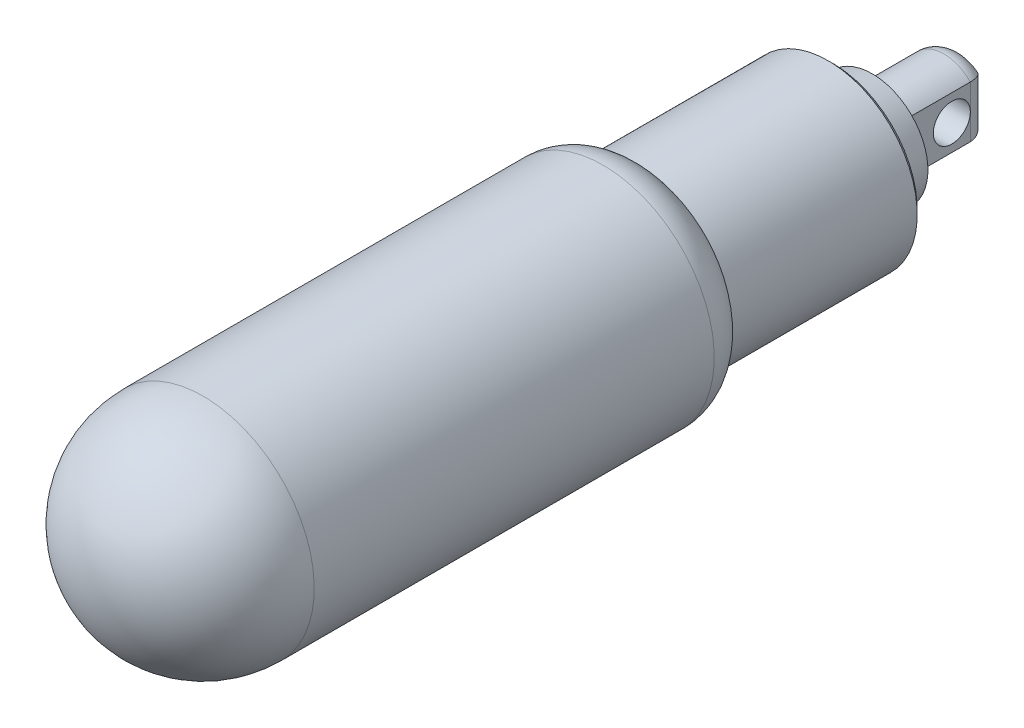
ISO-10303-21;
HEADER;
FILE_DESCRIPTION(('STEP AP214'),'2;1');
FILE_NAME('part.step','',(''),(''),'','','');
FILE_SCHEMA(('AUTOMOTIVE_DESIGN { 1 0 10303 214 1 1 1 1 }'));
ENDSEC;
DATA;
#1=APPLICATION_CONTEXT('core data for automotive mechanical design processes');
#2=APPLICATION_PROTOCOL_DEFINITION('international standard','automotive_design',2000,#1);
#3=PRODUCT_CONTEXT('',#1,'mechanical');
#4=PRODUCT('Part','Part','',(#3));
#5=PRODUCT_RELATED_PRODUCT_CATEGORY('part','',(#4));
#6=PRODUCT_DEFINITION_FORMATION('','',#4);
#7=PRODUCT_DEFINITION_CONTEXT('part definition',#1,'design');
#8=PRODUCT_DEFINITION('design','',#6,#7);
#9=PRODUCT_DEFINITION_SHAPE('','',#8);
#10=(LENGTH_UNIT() NAMED_UNIT(*) SI_UNIT(.MILLI.,.METRE.));
#11=(NAMED_UNIT(*) PLANE_ANGLE_UNIT() SI_UNIT($,.RADIAN.));
#12=(NAMED_UNIT(*) SI_UNIT($,.STERADIAN.) SOLID_ANGLE_UNIT());
#13=UNCERTAINTY_MEASURE_WITH_UNIT(LENGTH_MEASURE(1.E-05),#10,'distance_accuracy_value','');
#14=(GEOMETRIC_REPRESENTATION_CONTEXT(3) GLOBAL_UNCERTAINTY_ASSIGNED_CONTEXT((#13)) GLOBAL_UNIT_ASSIGNED_CONTEXT((#10,
#11,#12)) REPRESENTATION_CONTEXT('',''));
#15=CARTESIAN_POINT('',(0.,0.,0.));
#16=DIRECTION('',(0.,0.,1.));
#17=DIRECTION('',(1.,0.,0.));
#18=AXIS2_PLACEMENT_3D('',#15,#16,#17);
#19=CARTESIAN_POINT('',(0.,0.,-4.));
#20=DIRECTION('',(0.,0.,-1.));
#21=DIRECTION('',(-1.,0.,0.));
#22=AXIS2_PLACEMENT_3D('',#19,#20,#21);
#23=CYLINDRICAL_SURFACE('',#22,4.);
#24=DIRECTION('',(0.,0.,-1.));
#25=VECTOR('',#24,1.);
#26=CARTESIAN_POINT('',(-2.8571428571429,2.79941684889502,-4.));
#27=LINE('',#26,#25);
#28=CARTESIAN_POINT('',(-2.8571428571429,2.79941684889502,5.725));
#29=VERTEX_POINT('',#28);
#30=CARTESIAN_POINT('',(-2.8571428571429,2.79941684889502,-2.));
#31=VERTEX_POINT('',#30);
#32=EDGE_CURVE('E348',#29,#31,#27,.T.);
#33=ORIENTED_EDGE('',*,*,#32,.F.);
#34=CARTESIAN_POINT('',(0.,0.,5.725));
#35=DIRECTION('',(0.,0.,-1.));
#36=DIRECTION('',(-1.,0.,0.));
#37=AXIS2_PLACEMENT_3D('',#34,#35,#36);
#38=CIRCLE('',#37,4.);
#39=CARTESIAN_POINT('',(2.8571428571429,2.79941684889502,5.725));
#40=VERTEX_POINT('',#39);
#41=EDGE_CURVE('E101',#29,#40,#38,.T.);
#42=ORIENTED_EDGE('',*,*,#41,.T.);
#43=DIRECTION('',(0.,0.,-1.));
#44=VECTOR('',#43,1.);
#45=CARTESIAN_POINT('',(2.8571428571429,2.79941684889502,-4.));
#46=LINE('',#45,#44);
#47=CARTESIAN_POINT('',(2.8571428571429,2.79941684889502,-2.));
#48=VERTEX_POINT('',#47);
#49=EDGE_CURVE('E90',#48,#40,#46,.F.);
#50=ORIENTED_EDGE('',*,*,#49,.F.);
#51=CARTESIAN_POINT('',(0.,0.,-2.));
#52=DIRECTION('',(0.,0.,-1.));
#53=DIRECTION('',(-1.,0.,0.));
#54=AXIS2_PLACEMENT_3D('',#51,#52,#53);
#55=CIRCLE('',#54,4.);
#56=EDGE_CURVE('E99',#31,#48,#55,.T.);
#57=ORIENTED_EDGE('',*,*,#56,.F.);
#58=EDGE_LOOP('',(#33,#42,#50,#57));
#59=FACE_BOUND('',#58,.T.);
#60=ADVANCED_FACE('F14',(#59),#23,.T.);
#61=DIRECTION('',(0.,0.,-1.));
#62=VECTOR('',#61,1.);
#63=CARTESIAN_POINT('',(2.8571428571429,-2.79941684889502,-4.));
#64=LINE('',#63,#62);
#65=CARTESIAN_POINT('',(2.8571428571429,-2.79941684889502,5.725));
#66=VERTEX_POINT('',#65);
#67=CARTESIAN_POINT('',(2.8571428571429,-2.79941684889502,-2.));
#68=VERTEX_POINT('',#67);
#69=EDGE_CURVE('E102',#66,#68,#64,.T.);
#70=ORIENTED_EDGE('',*,*,#69,.F.);
#71=CARTESIAN_POINT('',(-2.8571428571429,-2.79941684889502,5.725));
#72=VERTEX_POINT('',#71);
#73=EDGE_CURVE('E116',#66,#72,#38,.T.);
#74=ORIENTED_EDGE('',*,*,#73,.T.);
#75=DIRECTION('',(0.,0.,-1.));
#76=VECTOR('',#75,1.);
#77=CARTESIAN_POINT('',(-2.8571428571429,-2.79941684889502,-4.));
#78=LINE('',#77,#76);
#79=CARTESIAN_POINT('',(-2.8571428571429,-2.79941684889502,-2.));
#80=VERTEX_POINT('',#79);
#81=EDGE_CURVE('E347',#80,#72,#78,.F.);
#82=ORIENTED_EDGE('',*,*,#81,.F.);
#83=EDGE_CURVE('E107',#68,#80,#55,.T.);
#84=ORIENTED_EDGE('',*,*,#83,.F.);
#85=EDGE_LOOP('',(#70,#74,#82,#84));
#86=FACE_BOUND('',#85,.T.);
#87=ADVANCED_FACE('F155',(#86),#23,.T.);
#88=CARTESIAN_POINT('',(0.,0.,-2.));
#89=DIRECTION('',(0.,0.,-1.));
#90=DIRECTION('',(-1.,0.,0.));
#91=AXIS2_PLACEMENT_3D('',#88,#89,#90);
#92=DEGENERATE_TOROIDAL_SURFACE('',#91,2.,2.,.T.);
#93=CARTESIAN_POINT('',(-2.8571428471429,2.79941684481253,-1.9998));
#94=CARTESIAN_POINT('',(-2.85715542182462,2.79942031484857,-2.05279635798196));
#95=CARTESIAN_POINT('',(-2.85504711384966,2.79856122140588,-2.10578949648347));
#96=CARTESIAN_POINT('',(-2.84664432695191,2.79512852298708,-2.21137855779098));
#97=CARTESIAN_POINT('',(-2.84035052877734,2.79255519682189,-2.26397454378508));
#98=CARTESIAN_POINT('',(-2.82365184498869,2.7857126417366,-2.36827407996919));
#99=CARTESIAN_POINT('',(-2.81325659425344,2.78144738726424,-2.4199794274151));
#100=CARTESIAN_POINT('',(-2.78847303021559,2.77124535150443,-2.52224127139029));
#101=CARTESIAN_POINT('',(-2.77408468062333,2.76530855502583,-2.57279775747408));
#102=CARTESIAN_POINT('',(-2.7251291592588,2.74502738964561,-2.72220510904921));
#103=CARTESIAN_POINT('',(-2.68475474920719,2.72820548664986,-2.81889700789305));
#104=CARTESIAN_POINT('',(-2.59013913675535,2.6882777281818,-3.00375750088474));
#105=CARTESIAN_POINT('',(-2.53589468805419,2.66517040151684,-3.09192409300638));
#106=CARTESIAN_POINT('',(-2.41405218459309,2.61240657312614,-3.25977799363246));
#107=CARTESIAN_POINT('',(-2.34616139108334,2.58260443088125,-3.33920686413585));
#108=CARTESIAN_POINT('',(-2.2003308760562,2.51724404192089,-3.48543577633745));
#109=CARTESIAN_POINT('',(-2.12238897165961,2.48168454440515,-3.55223306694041));
#110=CARTESIAN_POINT('',(-1.95361946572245,2.40274760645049,-3.67612715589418));
#111=CARTESIAN_POINT('',(-1.86228163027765,2.35900992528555,-3.73229774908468));
#112=CARTESIAN_POINT('',(-1.6740959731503,2.26600763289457,-3.8285983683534));
#113=CARTESIAN_POINT('',(-1.57724451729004,2.21673935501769,-3.86871767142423));
#114=CARTESIAN_POINT('',(-1.37743781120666,2.11126396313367,-3.9341011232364));
#115=CARTESIAN_POINT('',(-1.2743888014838,2.05486922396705,-3.95876963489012));
#116=CARTESIAN_POINT('',(-1.06871316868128,1.93709935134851,-3.99149493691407));
#117=CARTESIAN_POINT('',(-0.966086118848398,1.87573339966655,-3.99958165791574));
#118=CARTESIAN_POINT('',(-0.862445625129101,1.81036723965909,-3.9999947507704));
#119=CARTESIAN_POINT('',(-0.859793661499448,1.80869232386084,-4.00000002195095));
#120=CARTESIAN_POINT('',(-0.857142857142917,1.80701580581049,-4.00000000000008));
#121=B_SPLINE_CURVE_WITH_KNOTS('',3,(#93,#94,#95,#96,#97,#98,#99,#100,#101,#102,#103,#104,#105,
#106,#107,#108,#109,#110,#111,#112,#113,#114,#115,#116,#117,#118,#119,#120),.UNSPECIFIED.,.F.,
.F.,(4,2,2,2,2,2,2,2,2,2,2,2,2,4),(0.,0.158933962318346,0.31784208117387,0.476379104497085,
0.634917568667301,0.951684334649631,1.26852530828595,1.59307370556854,1.91769270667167,
2.26364888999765,2.60983580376,2.96865805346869,3.32683204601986,3.33624183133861),.UNSPECIFIED.);
#122=CARTESIAN_POINT('',(-0.857142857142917,1.80701580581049,-4.));
#123=VERTEX_POINT('',#122);
#124=EDGE_CURVE('E82',#31,#123,#121,.T.);
#125=ORIENTED_EDGE('',*,*,#124,.F.);
#126=ORIENTED_EDGE('',*,*,#56,.T.);
#127=CARTESIAN_POINT('',(0.857142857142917,1.80701580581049,-4.00000000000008));
#128=CARTESIAN_POINT('',(0.859793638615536,1.80869231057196,-4.00000003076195));
#129=CARTESIAN_POINT('',(0.86244560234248,1.81036722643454,-3.99999475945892));
#130=CARTESIAN_POINT('',(0.984938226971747,1.8876233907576,-3.99950612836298));
#131=CARTESIAN_POINT('',(1.10713295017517,1.95995639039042,-3.98818986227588));
#132=CARTESIAN_POINT('',(1.3514120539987,2.09757398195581,-3.9419600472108));
#133=CARTESIAN_POINT('',(1.47349530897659,2.16283963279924,-3.90698482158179));
#134=CARTESIAN_POINT('',(1.70967891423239,2.28419816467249,-3.81354930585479));
#135=CARTESIAN_POINT('',(1.82389269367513,2.34045405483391,-3.7555943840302));
#136=CARTESIAN_POINT('',(2.0416271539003,2.44446367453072,-3.61667366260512));
#137=CARTESIAN_POINT('',(2.14516108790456,2.49222799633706,-3.53573686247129));
#138=CARTESIAN_POINT('',(2.32546106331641,2.57350420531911,-3.36302609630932));
#139=CARTESIAN_POINT('',(2.40392824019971,2.60801507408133,-3.27349649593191));
#140=CARTESIAN_POINT('',(2.5446775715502,2.66898102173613,-3.08004838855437));
#141=CARTESIAN_POINT('',(2.60696433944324,2.69543839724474,-2.97613399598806));
#142=CARTESIAN_POINT('',(2.70743191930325,2.73768931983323,-2.76723066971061));
#143=CARTESIAN_POINT('',(2.74728640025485,2.75423226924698,-2.66319351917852));
#144=CARTESIAN_POINT('',(2.80921752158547,2.77981241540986,-2.44917306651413));
#145=CARTESIAN_POINT('',(2.83132756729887,2.78886371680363,-2.33920135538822));
#146=CARTESIAN_POINT('',(2.84844348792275,2.79586333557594,-2.19023504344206));
#147=CARTESIAN_POINT('',(2.8517096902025,2.79719797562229,-2.1522014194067));
#148=CARTESIAN_POINT('',(2.85605830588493,2.79897424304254,-2.07605126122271));
#149=CARTESIAN_POINT('',(2.85714428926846,2.79941733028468,-2.03793496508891));
#150=CARTESIAN_POINT('',(2.8571428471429,2.79941684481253,-1.9998));
#151=B_SPLINE_CURVE_WITH_KNOTS('',3,(#127,#128,#129,#130,#131,#132,#133,#134,#135,#136,#137,
#138,#139,#140,#141,#142,#143,#144,#145,#146,#147,#148,#149,#150),.UNSPECIFIED.,.F.,.F.,(4,2,2,
2,2,2,2,2,2,2,2,4),(0.,0.00940978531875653,0.43444327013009,0.860589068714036,1.27784118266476,
1.6945691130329,2.0644032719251,2.43413186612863,2.77033588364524,3.10590547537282,
3.22044242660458,3.3347916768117),.UNSPECIFIED.);
#152=CARTESIAN_POINT('',(0.85714285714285,1.80701580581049,-4.));
#153=VERTEX_POINT('',#152);
#154=EDGE_CURVE('E71',#153,#48,#151,.T.);
#155=ORIENTED_EDGE('',*,*,#154,.F.);
#156=CARTESIAN_POINT('',(0.,0.,-4.));
#157=DIRECTION('',(0.,0.,-1.));
#158=DIRECTION('',(-1.,0.,0.));
#159=AXIS2_PLACEMENT_3D('',#156,#157,#158);
#160=CIRCLE('',#159,2.);
#161=EDGE_CURVE('E112',#123,#153,#160,.T.);
#162=ORIENTED_EDGE('',*,*,#161,.F.);
#163=EDGE_LOOP('',(#125,#126,#155,#162));
#164=FACE_BOUND('',#163,.T.);
#165=ADVANCED_FACE('F106',(#164),#92,.T.);
#166=CARTESIAN_POINT('',(0.,-2.,-4.));
#167=DIRECTION('',(0.,0.,1.));
#168=DIRECTION('',(1.,0.,0.));
#169=AXIS2_PLACEMENT_3D('',#166,#167,#168);
#170=PLANE('',#169);
#171=CARTESIAN_POINT('',(0.857142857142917,-1.80701580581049,-4.));
#172=VERTEX_POINT('',#171);
#173=CARTESIAN_POINT('',(-0.857142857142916,-1.80701580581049,-4.));
#174=VERTEX_POINT('',#173);
#175=EDGE_CURVE('E108',#172,#174,#160,.T.);
#176=ORIENTED_EDGE('',*,*,#175,.T.);
#177=DIRECTION('',(0.,-1.,0.));
#178=VECTOR('',#177,1.);
#179=CARTESIAN_POINT('',(-0.857142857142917,12.,-4.));
#180=LINE('',#179,#178);
#181=EDGE_CURVE('E9',#174,#123,#180,.F.);
#182=ORIENTED_EDGE('',*,*,#181,.T.);
#183=ORIENTED_EDGE('',*,*,#161,.T.);
#184=DIRECTION('',(0.,-1.,0.));
#185=VECTOR('',#184,1.);
#186=CARTESIAN_POINT('',(0.857142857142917,12.,-4.));
#187=LINE('',#186,#185);
#188=EDGE_CURVE('E22',#172,#153,#187,.F.);
#189=ORIENTED_EDGE('',*,*,#188,.F.);
#190=EDGE_LOOP('',(#176,#182,#183,#189));
#191=FACE_BOUND('',#190,.T.);
#192=ADVANCED_FACE('F144',(#191),#170,.F.);
#193=CARTESIAN_POINT('',(0.,-7.8756445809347E-13,78.));
#194=DIRECTION('',(0.,0.,-1.));
#195=DIRECTION('',(0.,-1.,0.));
#196=AXIS2_PLACEMENT_3D('',#193,#194,#195);
#197=SPHERICAL_SURFACE('',#196,11.9999999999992);
#198=CARTESIAN_POINT('',(0.,0.,78.));
#199=DIRECTION('',(0.,0.,-1.));
#200=DIRECTION('',(-1.,0.,0.));
#201=AXIS2_PLACEMENT_3D('',#198,#199,#200);
#202=CIRCLE('',#201,12.);
#203=CARTESIAN_POINT('',(-12.,0.,78.));
#204=VERTEX_POINT('',#203);
#205=EDGE_CURVE('E137',#204,#204,#202,.T.);
#206=ORIENTED_EDGE('',*,*,#205,.F.);
#207=EDGE_LOOP('',(#206));
#208=FACE_BOUND('',#207,.T.);
#209=ADVANCED_FACE('F16',(#208),#197,.T.);
#210=CARTESIAN_POINT('',(0.,0.,-4.));
#211=DIRECTION('',(0.,0.,-1.));
#212=DIRECTION('',(-1.,0.,0.));
#213=AXIS2_PLACEMENT_3D('',#210,#211,#212);
#214=CYLINDRICAL_SURFACE('',#213,12.);
#215=CARTESIAN_POINT('',(0.,0.,34.8));
#216=DIRECTION('',(0.,0.,-1.));
#217=DIRECTION('',(-1.,0.,0.));
#218=AXIS2_PLACEMENT_3D('',#215,#216,#217);
#219=CIRCLE('',#218,12.);
#220=CARTESIAN_POINT('',(-12.,0.,34.8));
#221=VERTEX_POINT('',#220);
#222=EDGE_CURVE('E134',#221,#221,#219,.T.);
#223=ORIENTED_EDGE('',*,*,#222,.F.);
#224=EDGE_LOOP('',(#223));
#225=FACE_BOUND('',#224,.T.);
#226=ORIENTED_EDGE('',*,*,#205,.T.);
#227=EDGE_LOOP('',(#226));
#228=FACE_BOUND('',#227,.T.);
#229=ADVANCED_FACE('F141',(#225,#228),#214,.T.);
#230=CARTESIAN_POINT('',(0.,0.,34.8000000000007));
#231=DIRECTION('',(0.,0.,-1.));
#232=DIRECTION('',(-1.,0.,0.));
#233=AXIS2_PLACEMENT_3D('',#230,#231,#232);
#234=TOROIDAL_SURFACE('',#233,7.19999999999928,4.80000000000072);
#235=ORIENTED_EDGE('',*,*,#222,.T.);
#236=EDGE_LOOP('',(#235));
#237=FACE_BOUND('',#236,.T.);
#238=CARTESIAN_POINT('',(0.,0.,30.643078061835));
#239=DIRECTION('',(0.,0.,-1.));
#240=DIRECTION('',(-1.,0.,0.));
#241=AXIS2_PLACEMENT_3D('',#238,#239,#240);
#242=CIRCLE('',#241,9.6);
#243=CARTESIAN_POINT('',(-9.6,0.,30.643078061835));
#244=VERTEX_POINT('',#243);
#245=EDGE_CURVE('E131',#244,#244,#242,.T.);
#246=ORIENTED_EDGE('',*,*,#245,.F.);
#247=EDGE_LOOP('',(#246));
#248=FACE_BOUND('',#247,.T.);
#249=ADVANCED_FACE('F150',(#237,#248),#234,.T.);
#250=CARTESIAN_POINT('',(0.,0.,-4.));
#251=DIRECTION('',(0.,0.,-1.));
#252=DIRECTION('',(-1.,0.,0.));
#253=AXIS2_PLACEMENT_3D('',#250,#251,#252);
#254=CYLINDRICAL_SURFACE('',#253,9.6);
#255=CARTESIAN_POINT('',(0.,0.,10.48));
#256=DIRECTION('',(0.,0.,-1.));
#257=DIRECTION('',(-1.,0.,0.));
#258=AXIS2_PLACEMENT_3D('',#255,#256,#257);
#259=CIRCLE('',#258,9.6);
#260=CARTESIAN_POINT('',(-9.6,0.,10.48));
#261=VERTEX_POINT('',#260);
#262=EDGE_CURVE('E128',#261,#261,#259,.T.);
#263=ORIENTED_EDGE('',*,*,#262,.F.);
#264=EDGE_LOOP('',(#263));
#265=FACE_BOUND('',#264,.T.);
#266=ORIENTED_EDGE('',*,*,#245,.T.);
#267=EDGE_LOOP('',(#266));
#268=FACE_BOUND('',#267,.T.);
#269=ADVANCED_FACE('F180',(#265,#268),#254,.T.);
#270=CARTESIAN_POINT('',(0.,0.,10.48));
#271=DIRECTION('',(0.,0.,1.));
#272=DIRECTION('',(1.,0.,0.));
#273=AXIS2_PLACEMENT_3D('',#270,#271,#272);
#274=CONICAL_SURFACE('',#273,9.6,0.785398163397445);
#275=CARTESIAN_POINT('',(0.,0.,10.));
#276=DIRECTION('',(0.,0.,-1.));
#277=DIRECTION('',(-1.,0.,0.));
#278=AXIS2_PLACEMENT_3D('',#275,#276,#277);
#279=CIRCLE('',#278,9.12);
#280=CARTESIAN_POINT('',(-9.12,0.,10.));
#281=VERTEX_POINT('',#280);
#282=EDGE_CURVE('E125',#281,#281,#279,.T.);
#283=ORIENTED_EDGE('',*,*,#282,.F.);
#284=EDGE_LOOP('',(#283));
#285=FACE_BOUND('',#284,.T.);
#286=ORIENTED_EDGE('',*,*,#262,.T.);
#287=EDGE_LOOP('',(#286));
#288=FACE_BOUND('',#287,.T.);
#289=ADVANCED_FACE('F176',(#285,#288),#274,.T.);
#290=CARTESIAN_POINT('',(0.,-9.12,10.));
#291=DIRECTION('',(0.,0.,1.));
#292=DIRECTION('',(1.,0.,0.));
#293=AXIS2_PLACEMENT_3D('',#290,#291,#292);
#294=PLANE('',#293);
#295=CARTESIAN_POINT('',(0.,0.,10.));
#296=DIRECTION('',(0.,0.,-1.));
#297=DIRECTION('',(-1.,0.,0.));
#298=AXIS2_PLACEMENT_3D('',#295,#296,#297);
#299=CIRCLE('',#298,6.6008120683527);
#300=CARTESIAN_POINT('',(-6.6008120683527,0.,10.));
#301=VERTEX_POINT('',#300);
#302=EDGE_CURVE('E122',#301,#301,#299,.T.);
#303=ORIENTED_EDGE('',*,*,#302,.F.);
#304=EDGE_LOOP('',(#303));
#305=FACE_BOUND('',#304,.T.);
#306=ORIENTED_EDGE('',*,*,#282,.T.);
#307=EDGE_LOOP('',(#306));
#308=FACE_BOUND('',#307,.T.);
#309=ADVANCED_FACE('F172',(#305,#308),#294,.F.);
#310=CARTESIAN_POINT('',(0.,0.,10.));
#311=DIRECTION('',(0.,0.,1.));
#312=DIRECTION('',(1.,0.,0.));
#313=AXIS2_PLACEMENT_3D('',#310,#311,#312);
#314=CONICAL_SURFACE('',#313,6.6008120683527,0.139626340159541);
#315=CARTESIAN_POINT('',(0.,0.,5.725));
#316=DIRECTION('',(0.,0.,-1.));
#317=DIRECTION('',(-1.,0.,0.));
#318=AXIS2_PLACEMENT_3D('',#315,#316,#317);
#319=CIRCLE('',#318,6.);
#320=CARTESIAN_POINT('',(-6.,0.,5.725));
#321=VERTEX_POINT('',#320);
#322=EDGE_CURVE('E119',#321,#321,#319,.T.);
#323=ORIENTED_EDGE('',*,*,#322,.F.);
#324=EDGE_LOOP('',(#323));
#325=FACE_BOUND('',#324,.T.);
#326=ORIENTED_EDGE('',*,*,#302,.T.);
#327=EDGE_LOOP('',(#326));
#328=FACE_BOUND('',#327,.T.);
#329=ADVANCED_FACE('F168',(#325,#328),#314,.T.);
#330=CARTESIAN_POINT('',(0.,-6.,5.725));
#331=DIRECTION('',(0.,0.,1.));
#332=DIRECTION('',(1.,0.,0.));
#333=AXIS2_PLACEMENT_3D('',#330,#331,#332);
#334=PLANE('',#333);
#335=ORIENTED_EDGE('',*,*,#73,.F.);
#336=DIRECTION('',(0.,-1.,0.));
#337=VECTOR('',#336,1.);
#338=CARTESIAN_POINT('',(2.8571428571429,12.,5.725));
#339=LINE('',#338,#337);
#340=EDGE_CURVE('E356',#40,#66,#339,.T.);
#341=ORIENTED_EDGE('',*,*,#340,.F.);
#342=ORIENTED_EDGE('',*,*,#41,.F.);
#343=DIRECTION('',(0.,-1.,0.));
#344=VECTOR('',#343,1.);
#345=CARTESIAN_POINT('',(-2.8571428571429,12.,5.725));
#346=LINE('',#345,#344);
#347=EDGE_CURVE('E362',#29,#72,#346,.T.);
#348=ORIENTED_EDGE('',*,*,#347,.T.);
#349=EDGE_LOOP('',(#335,#341,#342,#348));
#350=FACE_BOUND('',#349,.T.);
#351=ORIENTED_EDGE('',*,*,#322,.T.);
#352=EDGE_LOOP('',(#351));
#353=FACE_BOUND('',#352,.T.);
#354=ADVANCED_FACE('F165',(#350,#353),#334,.F.);
#355=CARTESIAN_POINT('',(2.8571428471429,-2.79941684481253,-1.9998));
#356=CARTESIAN_POINT('',(2.85715542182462,-2.79942031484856,-2.05279635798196));
#357=CARTESIAN_POINT('',(2.85504711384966,-2.79856122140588,-2.10578949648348));
#358=CARTESIAN_POINT('',(2.84664432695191,-2.79512852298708,-2.211378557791));
#359=CARTESIAN_POINT('',(2.84035052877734,-2.79255519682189,-2.26397454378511));
#360=CARTESIAN_POINT('',(2.82365184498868,-2.7857126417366,-2.36827407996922));
#361=CARTESIAN_POINT('',(2.81325659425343,-2.78144738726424,-2.41997942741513));
#362=CARTESIAN_POINT('',(2.78847303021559,-2.77124535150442,-2.52224127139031));
#363=CARTESIAN_POINT('',(2.77408468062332,-2.76530855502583,-2.5727977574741));
#364=CARTESIAN_POINT('',(2.7251291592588,-2.74502738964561,-2.72220510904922));
#365=CARTESIAN_POINT('',(2.68475474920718,-2.72820548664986,-2.81889700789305));
#366=CARTESIAN_POINT('',(2.59013913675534,-2.68827772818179,-3.00375750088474));
#367=CARTESIAN_POINT('',(2.53589468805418,-2.66517040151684,-3.09192409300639));
#368=CARTESIAN_POINT('',(2.41405218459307,-2.61240657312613,-3.25977799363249));
#369=CARTESIAN_POINT('',(2.34616139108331,-2.58260443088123,-3.33920686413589));
#370=CARTESIAN_POINT('',(2.20033087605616,-2.51724404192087,-3.48543577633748));
#371=CARTESIAN_POINT('',(2.12238897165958,-2.48168454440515,-3.55223306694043));
#372=CARTESIAN_POINT('',(1.95361946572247,-2.40274760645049,-3.67612715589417));
#373=CARTESIAN_POINT('',(1.86228163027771,-2.35900992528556,-3.73229774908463));
#374=CARTESIAN_POINT('',(1.67409597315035,-2.26600763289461,-3.8285983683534));
#375=CARTESIAN_POINT('',(1.57724451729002,-2.21673935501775,-3.86871767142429));
#376=CARTESIAN_POINT('',(1.37743781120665,-2.11126396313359,-3.93410112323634));
#377=CARTESIAN_POINT('',(1.27438880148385,-2.0548692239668,-3.95876963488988));
#378=CARTESIAN_POINT('',(1.0687131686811,-1.93709935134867,-3.99149493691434));
#379=CARTESIAN_POINT('',(0.966086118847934,-1.8757333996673,-3.99958165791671));
#380=CARTESIAN_POINT('',(0.862445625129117,-1.81036723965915,-3.99999475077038));
#381=CARTESIAN_POINT('',(0.859793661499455,-1.80869232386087,-4.0000000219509));
#382=CARTESIAN_POINT('',(0.857142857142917,-1.80701580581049,-4.));
#383=B_SPLINE_CURVE_WITH_KNOTS('',3,(#355,#356,#357,#358,#359,#360,#361,#362,#363,#364,#365,
#366,#367,#368,#369,#370,#371,#372,#373,#374,#375,#376,#377,#378,#379,#380,#381,#382),
.UNSPECIFIED.,.F.,.F.,(4,2,2,2,2,2,2,2,2,2,2,2,2,4),(0.,0.15893396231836,0.3178420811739,
0.476379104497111,0.634917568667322,0.951684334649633,1.26852530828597,1.5930737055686,
1.91769270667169,2.26364888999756,2.60983580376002,2.96865805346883,3.32683204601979,
3.33624183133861),.UNSPECIFIED.);
#384=EDGE_CURVE('E83',#68,#172,#383,.T.);
#385=ORIENTED_EDGE('',*,*,#384,.F.);
#386=ORIENTED_EDGE('',*,*,#83,.T.);
#387=CARTESIAN_POINT('',(-0.857142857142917,-1.80701580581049,-4.));
#388=CARTESIAN_POINT('',(-0.85979363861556,-1.80869231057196,-4.0000000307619));
#389=CARTESIAN_POINT('',(-0.862445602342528,-1.81036722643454,-3.9999947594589));
#390=CARTESIAN_POINT('',(-0.98493822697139,-1.88762339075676,-3.99950612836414));
#391=CARTESIAN_POINT('',(-1.10713295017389,-1.9599563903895,-3.98818986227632));
#392=CARTESIAN_POINT('',(-1.35141205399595,-2.09757398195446,-3.94196004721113));
#393=CARTESIAN_POINT('',(-1.47349530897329,-2.16283963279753,-3.90698482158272));
#394=CARTESIAN_POINT('',(-1.70967891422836,-2.28419816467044,-3.81354930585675));
#395=CARTESIAN_POINT('',(-1.8238926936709,-2.34045405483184,-3.75559438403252));
#396=CARTESIAN_POINT('',(-2.04162715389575,-2.4444636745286,-3.61667366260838));
#397=CARTESIAN_POINT('',(-2.1451610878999,-2.49222799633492,-3.53573686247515));
#398=CARTESIAN_POINT('',(-2.32546106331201,-2.57350420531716,-3.36302609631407));
#399=CARTESIAN_POINT('',(-2.40392824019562,-2.60801507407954,-3.27349649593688));
#400=CARTESIAN_POINT('',(-2.54467757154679,-2.66898102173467,-3.0800483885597));
#401=CARTESIAN_POINT('',(-2.6069643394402,-2.69543839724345,-2.97613399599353));
#402=CARTESIAN_POINT('',(-2.70743191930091,-2.73768931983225,-2.76723066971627));
#403=CARTESIAN_POINT('',(-2.74728640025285,-2.75423226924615,-2.66319351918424));
#404=CARTESIAN_POINT('',(-2.80921752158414,-2.77981241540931,-2.44917306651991));
#405=CARTESIAN_POINT('',(-2.83132756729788,-2.78886371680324,-2.33920135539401));
#406=CARTESIAN_POINT('',(-2.84844348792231,-2.79586333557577,-2.19023504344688));
#407=CARTESIAN_POINT('',(-2.85170969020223,-2.79719797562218,-2.15220141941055));
#408=CARTESIAN_POINT('',(-2.85605830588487,-2.79897424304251,-2.07605126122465));
#409=CARTESIAN_POINT('',(-2.85714428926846,-2.79941733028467,-2.03793496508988));
#410=CARTESIAN_POINT('',(-2.8571428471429,-2.79941684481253,-1.9998));
#411=B_SPLINE_CURVE_WITH_KNOTS('',3,(#387,#388,#389,#390,#391,#392,#393,#394,#395,#396,#397,
#398,#399,#400,#401,#402,#403,#404,#405,#406,#407,#408,#409,#410),.UNSPECIFIED.,.F.,.F.,(4,2,2,
2,2,2,2,2,2,2,2,4),(0.,0.0094097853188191,0.434443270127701,0.860589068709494,1.27784118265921,
1.69456911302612,2.06440327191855,2.43413186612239,2.77033588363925,3.10590547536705,
3.22044242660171,3.33479167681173),.UNSPECIFIED.);
#412=EDGE_CURVE('E103',#174,#80,#411,.T.);
#413=ORIENTED_EDGE('',*,*,#412,.F.);
#414=ORIENTED_EDGE('',*,*,#175,.F.);
#415=EDGE_LOOP('',(#385,#386,#413,#414));
#416=FACE_BOUND('',#415,.T.);
#417=ADVANCED_FACE('F163',(#416),#92,.T.);
#418=CARTESIAN_POINT('',(0.857142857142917,12.,-2.));
#419=DIRECTION('',(0.,-1.,0.));
#420=DIRECTION('',(1.,0.,0.));
#421=AXIS2_PLACEMENT_3D('',#418,#419,#420);
#422=CYLINDRICAL_SURFACE('',#421,2.);
#423=ORIENTED_EDGE('',*,*,#154,.T.);
#424=DIRECTION('',(0.,-1.,0.));
#425=VECTOR('',#424,1.);
#426=CARTESIAN_POINT('',(2.8571428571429,12.,-2.));
#427=LINE('',#426,#425);
#428=CARTESIAN_POINT('',(2.8571428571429,0.,-2.));
#429=VERTEX_POINT('',#428);
#430=EDGE_CURVE('E75',#48,#429,#427,.T.);
#431=ORIENTED_EDGE('',*,*,#430,.T.);
#432=EDGE_CURVE('E93',#429,#68,#427,.T.);
#433=ORIENTED_EDGE('',*,*,#432,.T.);
#434=ORIENTED_EDGE('',*,*,#384,.T.);
#435=ORIENTED_EDGE('',*,*,#188,.T.);
#436=EDGE_LOOP('',(#423,#431,#433,#434,#435));
#437=FACE_BOUND('',#436,.T.);
#438=ADVANCED_FACE('F73',(#437),#422,.T.);
#439=CARTESIAN_POINT('',(2.8571428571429,12.,-2.));
#440=DIRECTION('',(1.,0.,0.));
#441=DIRECTION('',(0.,0.,-1.));
#442=AXIS2_PLACEMENT_3D('',#439,#440,#441);
#443=PLANE('',#442);
#444=ORIENTED_EDGE('',*,*,#432,.F.);
#445=CARTESIAN_POINT('',(2.8571428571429,0.,0.));
#446=DIRECTION('',(1.,0.,0.));
#447=DIRECTION('',(0.,0.,-1.));
#448=AXIS2_PLACEMENT_3D('',#445,#446,#447);
#449=CIRCLE('',#448,2.);
#450=EDGE_CURVE('E27',#429,#429,#449,.F.);
#451=ORIENTED_EDGE('',*,*,#450,.T.);
#452=ORIENTED_EDGE('',*,*,#430,.F.);
#453=ORIENTED_EDGE('',*,*,#49,.T.);
#454=ORIENTED_EDGE('',*,*,#340,.T.);
#455=ORIENTED_EDGE('',*,*,#69,.T.);
#456=EDGE_LOOP('',(#444,#451,#452,#453,#454,#455));
#457=FACE_BOUND('',#456,.T.);
#458=ADVANCED_FACE('F88',(#457),#443,.T.);
#459=CARTESIAN_POINT('',(-2.8571428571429,12.,5.725));
#460=DIRECTION('',(-1.,0.,0.));
#461=DIRECTION('',(0.,0.,1.));
#462=AXIS2_PLACEMENT_3D('',#459,#460,#461);
#463=PLANE('',#462);
#464=DIRECTION('',(0.,-1.,0.));
#465=VECTOR('',#464,1.);
#466=CARTESIAN_POINT('',(-2.8571428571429,12.,-2.));
#467=LINE('',#466,#465);
#468=CARTESIAN_POINT('',(-2.8571428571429,0.,-2.));
#469=VERTEX_POINT('',#468);
#470=EDGE_CURVE('E361',#31,#469,#467,.T.);
#471=ORIENTED_EDGE('',*,*,#470,.T.);
#472=CARTESIAN_POINT('',(-2.8571428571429,0.,0.));
#473=DIRECTION('',(-1.,0.,0.));
#474=DIRECTION('',(0.,0.,1.));
#475=AXIS2_PLACEMENT_3D('',#472,#473,#474);
#476=CIRCLE('',#475,2.);
#477=EDGE_CURVE('E32',#469,#469,#476,.F.);
#478=ORIENTED_EDGE('',*,*,#477,.T.);
#479=EDGE_CURVE('E92',#469,#80,#467,.T.);
#480=ORIENTED_EDGE('',*,*,#479,.T.);
#481=ORIENTED_EDGE('',*,*,#81,.T.);
#482=ORIENTED_EDGE('',*,*,#347,.F.);
#483=ORIENTED_EDGE('',*,*,#32,.T.);
#484=EDGE_LOOP('',(#471,#478,#480,#481,#482,#483));
#485=FACE_BOUND('',#484,.T.);
#486=ADVANCED_FACE('F235',(#485),#463,.T.);
#487=CARTESIAN_POINT('',(-0.857142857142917,12.,-2.));
#488=DIRECTION('',(0.,-1.,0.));
#489=DIRECTION('',(1.,0.,0.));
#490=AXIS2_PLACEMENT_3D('',#487,#488,#489);
#491=CYLINDRICAL_SURFACE('',#490,2.);
#492=ORIENTED_EDGE('',*,*,#412,.T.);
#493=ORIENTED_EDGE('',*,*,#479,.F.);
#494=ORIENTED_EDGE('',*,*,#470,.F.);
#495=ORIENTED_EDGE('',*,*,#124,.T.);
#496=ORIENTED_EDGE('',*,*,#181,.F.);
#497=EDGE_LOOP('',(#492,#493,#494,#495,#496));
#498=FACE_BOUND('',#497,.T.);
#499=ADVANCED_FACE('F242',(#498),#491,.T.);
#500=CARTESIAN_POINT('',(-12.,0.,0.));
#501=DIRECTION('',(1.,0.,0.));
#502=DIRECTION('',(0.,0.,-1.));
#503=AXIS2_PLACEMENT_3D('',#500,#501,#502);
#504=CYLINDRICAL_SURFACE('',#503,2.);
#505=ORIENTED_EDGE('',*,*,#450,.F.);
#506=EDGE_LOOP('',(#505));
#507=FACE_BOUND('',#506,.T.);
#508=ORIENTED_EDGE('',*,*,#477,.F.);
#509=EDGE_LOOP('',(#508));
#510=FACE_BOUND('',#509,.T.);
#511=ADVANCED_FACE('F250',(#507,#510),#504,.F.);
#512=CLOSED_SHELL('',(#60,#87,#165,#192,#209,#229,#249,#269,#289,#309,#329,#354,#417,#438,#458,
#486,#499,#511));
#513=MANIFOLD_SOLID_BREP('B1',#512);
#514=ADVANCED_BREP_SHAPE_REPRESENTATION('',(#18,#513),#14);
#515=SHAPE_DEFINITION_REPRESENTATION(#9,#514);
ENDSEC;
END-ISO-10303-21;
